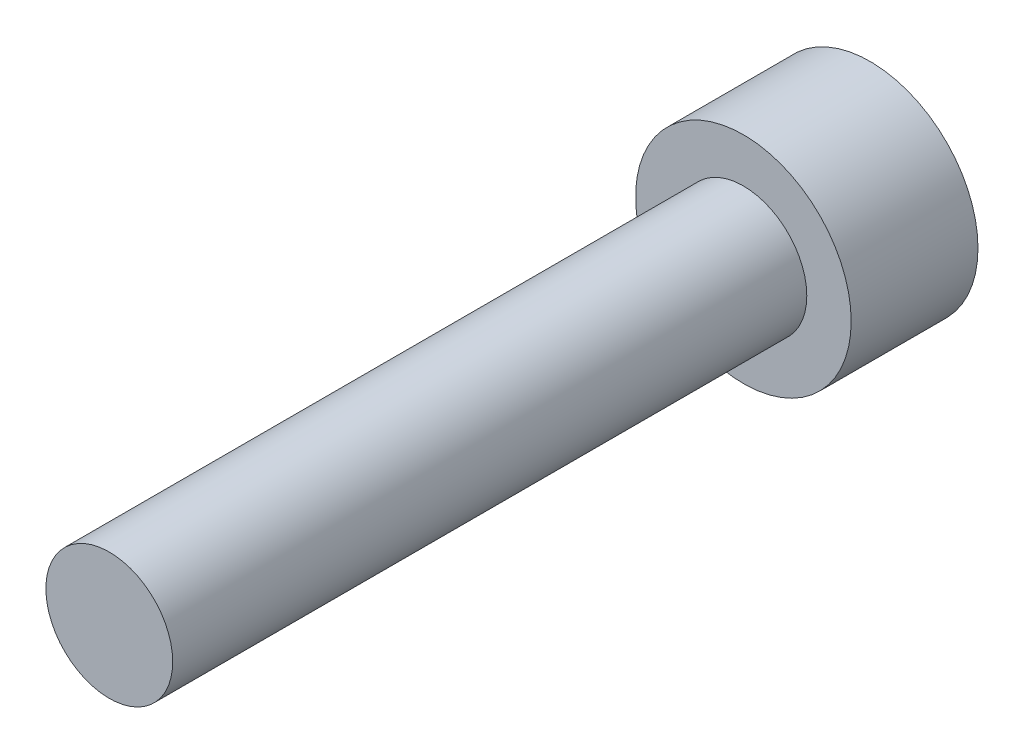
ISO-10303-21;
HEADER;
FILE_DESCRIPTION(('STEP AP214'),'2;1');
FILE_NAME('part.step','',(''),(''),'','','');
FILE_SCHEMA(('AUTOMOTIVE_DESIGN { 1 0 10303 214 1 1 1 1 }'));
ENDSEC;
DATA;
#1=APPLICATION_CONTEXT('core data for automotive mechanical design processes');
#2=APPLICATION_PROTOCOL_DEFINITION('international standard','automotive_design',2000,#1);
#3=PRODUCT_CONTEXT('',#1,'mechanical');
#4=PRODUCT('Part','Part','',(#3));
#5=PRODUCT_RELATED_PRODUCT_CATEGORY('part','',(#4));
#6=PRODUCT_DEFINITION_FORMATION('','',#4);
#7=PRODUCT_DEFINITION_CONTEXT('part definition',#1,'design');
#8=PRODUCT_DEFINITION('design','',#6,#7);
#9=PRODUCT_DEFINITION_SHAPE('','',#8);
#10=(LENGTH_UNIT() NAMED_UNIT(*) SI_UNIT(.MILLI.,.METRE.));
#11=(NAMED_UNIT(*) PLANE_ANGLE_UNIT() SI_UNIT($,.RADIAN.));
#12=(NAMED_UNIT(*) SI_UNIT($,.STERADIAN.) SOLID_ANGLE_UNIT());
#13=UNCERTAINTY_MEASURE_WITH_UNIT(LENGTH_MEASURE(1.E-05),#10,'distance_accuracy_value','');
#14=(GEOMETRIC_REPRESENTATION_CONTEXT(3) GLOBAL_UNCERTAINTY_ASSIGNED_CONTEXT((#13)) GLOBAL_UNIT_ASSIGNED_CONTEXT((#10,
#11,#12)) REPRESENTATION_CONTEXT('',''));
#15=CARTESIAN_POINT('',(0.,0.,0.));
#16=DIRECTION('',(0.,0.,1.));
#17=DIRECTION('',(1.,0.,0.));
#18=AXIS2_PLACEMENT_3D('',#15,#16,#17);
#19=CARTESIAN_POINT('',(0.,0.,25.));
#20=DIRECTION('',(0.,0.,1.));
#21=DIRECTION('',(1.,0.,0.));
#22=AXIS2_PLACEMENT_3D('',#19,#20,#21);
#23=PLANE('',#22);
#24=CARTESIAN_POINT('',(0.,0.,25.));
#25=DIRECTION('',(0.,0.,1.));
#26=DIRECTION('',(1.,0.,0.));
#27=AXIS2_PLACEMENT_3D('',#24,#25,#26);
#28=CIRCLE('',#27,2.5);
#29=CARTESIAN_POINT('',(2.5,0.,25.));
#30=VERTEX_POINT('',#29);
#31=EDGE_CURVE('E11',#30,#30,#28,.T.);
#32=ORIENTED_EDGE('',*,*,#31,.T.);
#33=EDGE_LOOP('',(#32));
#34=FACE_BOUND('',#33,.T.);
#35=ADVANCED_FACE('F32',(#34),#23,.T.);
#36=CARTESIAN_POINT('',(0.,0.,25.));
#37=DIRECTION('',(0.,0.,1.));
#38=DIRECTION('',(1.,0.,0.));
#39=AXIS2_PLACEMENT_3D('',#36,#37,#38);
#40=CYLINDRICAL_SURFACE('',#39,2.5);
#41=CARTESIAN_POINT('',(0.,0.,0.));
#42=DIRECTION('',(0.,0.,1.));
#43=DIRECTION('',(1.,0.,0.));
#44=AXIS2_PLACEMENT_3D('',#41,#42,#43);
#45=CIRCLE('',#44,2.5);
#46=CARTESIAN_POINT('',(2.5,0.,0.));
#47=VERTEX_POINT('',#46);
#48=EDGE_CURVE('E39',#47,#47,#45,.T.);
#49=ORIENTED_EDGE('',*,*,#48,.T.);
#50=EDGE_LOOP('',(#49));
#51=FACE_BOUND('',#50,.T.);
#52=ORIENTED_EDGE('',*,*,#31,.F.);
#53=EDGE_LOOP('',(#52));
#54=FACE_BOUND('',#53,.T.);
#55=ADVANCED_FACE('F146',(#51,#54),#40,.T.);
#56=CARTESIAN_POINT('',(0.,-2.5,0.));
#57=DIRECTION('',(0.,0.,1.));
#58=DIRECTION('',(1.,0.,0.));
#59=AXIS2_PLACEMENT_3D('',#56,#57,#58);
#60=PLANE('',#59);
#61=CARTESIAN_POINT('',(0.,0.,0.));
#62=DIRECTION('',(0.,0.,1.));
#63=DIRECTION('',(1.,0.,0.));
#64=AXIS2_PLACEMENT_3D('',#61,#62,#63);
#65=CIRCLE('',#64,4.25);
#66=CARTESIAN_POINT('',(4.25,0.,0.));
#67=VERTEX_POINT('',#66);
#68=EDGE_CURVE('E141',#67,#67,#65,.T.);
#69=ORIENTED_EDGE('',*,*,#68,.T.);
#70=EDGE_LOOP('',(#69));
#71=FACE_BOUND('',#70,.T.);
#72=ORIENTED_EDGE('',*,*,#48,.F.);
#73=EDGE_LOOP('',(#72));
#74=FACE_BOUND('',#73,.T.);
#75=ADVANCED_FACE('F149',(#71,#74),#60,.T.);
#76=CARTESIAN_POINT('',(0.,0.,25.));
#77=DIRECTION('',(0.,0.,1.));
#78=DIRECTION('',(1.,0.,0.));
#79=AXIS2_PLACEMENT_3D('',#76,#77,#78);
#80=CYLINDRICAL_SURFACE('',#79,4.25);
#81=CARTESIAN_POINT('',(0.,0.,-5.));
#82=DIRECTION('',(0.,0.,1.));
#83=DIRECTION('',(1.,0.,0.));
#84=AXIS2_PLACEMENT_3D('',#81,#82,#83);
#85=CIRCLE('',#84,4.25);
#86=CARTESIAN_POINT('',(4.25,0.,-5.));
#87=VERTEX_POINT('',#86);
#88=EDGE_CURVE('E133',#87,#87,#85,.T.);
#89=ORIENTED_EDGE('',*,*,#88,.T.);
#90=EDGE_LOOP('',(#89));
#91=FACE_BOUND('',#90,.T.);
#92=ORIENTED_EDGE('',*,*,#68,.F.);
#93=EDGE_LOOP('',(#92));
#94=FACE_BOUND('',#93,.T.);
#95=ADVANCED_FACE('F151',(#91,#94),#80,.T.);
#96=CARTESIAN_POINT('',(0.,-4.25,-5.));
#97=DIRECTION('',(0.,0.,-1.));
#98=DIRECTION('',(-1.,0.,0.));
#99=AXIS2_PLACEMENT_3D('',#96,#97,#98);
#100=PLANE('',#99);
#101=DIRECTION('',(0.866025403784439,-0.5,0.));
#102=VECTOR('',#101,1.);
#103=CARTESIAN_POINT('',(0.,2.3094010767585,-5.));
#104=LINE('',#103,#102);
#105=CARTESIAN_POINT('',(0.,2.3094010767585,-5.));
#106=VERTEX_POINT('',#105);
#107=CARTESIAN_POINT('',(2.,1.15470053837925,-5.));
#108=VERTEX_POINT('',#107);
#109=EDGE_CURVE('E46',#106,#108,#104,.T.);
#110=ORIENTED_EDGE('',*,*,#109,.F.);
#111=DIRECTION('',(0.866025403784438,0.5,0.));
#112=VECTOR('',#111,1.);
#113=CARTESIAN_POINT('',(-2.,1.15470053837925,-5.));
#114=LINE('',#113,#112);
#115=CARTESIAN_POINT('',(-2.,1.15470053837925,-5.));
#116=VERTEX_POINT('',#115);
#117=EDGE_CURVE('E129',#116,#106,#114,.T.);
#118=ORIENTED_EDGE('',*,*,#117,.F.);
#119=DIRECTION('',(0.,1.,0.));
#120=VECTOR('',#119,1.);
#121=CARTESIAN_POINT('',(-2.,-1.15470053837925,-5.));
#122=LINE('',#121,#120);
#123=CARTESIAN_POINT('',(-2.,-1.15470053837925,-5.));
#124=VERTEX_POINT('',#123);
#125=EDGE_CURVE('E127',#124,#116,#122,.T.);
#126=ORIENTED_EDGE('',*,*,#125,.F.);
#127=DIRECTION('',(-0.866025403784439,0.5,0.));
#128=VECTOR('',#127,1.);
#129=CARTESIAN_POINT('',(0.,-2.3094010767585,-5.));
#130=LINE('',#129,#128);
#131=CARTESIAN_POINT('',(0.,-2.3094010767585,-5.));
#132=VERTEX_POINT('',#131);
#133=EDGE_CURVE('E94',#132,#124,#130,.T.);
#134=ORIENTED_EDGE('',*,*,#133,.F.);
#135=DIRECTION('',(-0.866025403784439,-0.5,0.));
#136=VECTOR('',#135,1.);
#137=CARTESIAN_POINT('',(2.,-1.15470053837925,-5.));
#138=LINE('',#137,#136);
#139=CARTESIAN_POINT('',(2.,-1.15470053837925,-5.));
#140=VERTEX_POINT('',#139);
#141=EDGE_CURVE('E123',#140,#132,#138,.T.);
#142=ORIENTED_EDGE('',*,*,#141,.F.);
#143=DIRECTION('',(0.,-1.,0.));
#144=VECTOR('',#143,1.);
#145=CARTESIAN_POINT('',(2.,1.15470053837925,-5.));
#146=LINE('',#145,#144);
#147=EDGE_CURVE('E120',#108,#140,#146,.T.);
#148=ORIENTED_EDGE('',*,*,#147,.F.);
#149=EDGE_LOOP('',(#110,#118,#126,#134,#142,#148));
#150=FACE_BOUND('',#149,.T.);
#151=ORIENTED_EDGE('',*,*,#88,.F.);
#152=EDGE_LOOP('',(#151));
#153=FACE_BOUND('',#152,.T.);
#154=ADVANCED_FACE('F158',(#150,#153),#100,.T.);
#155=CARTESIAN_POINT('',(0.,2.3094010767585,-0.999999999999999));
#156=DIRECTION('',(0.5,0.866025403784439,0.));
#157=DIRECTION('',(-0.866025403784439,0.5,0.));
#158=AXIS2_PLACEMENT_3D('',#155,#156,#157);
#159=PLANE('',#158);
#160=ORIENTED_EDGE('',*,*,#109,.T.);
#161=DIRECTION('',(0.,0.,-1.));
#162=VECTOR('',#161,1.);
#163=CARTESIAN_POINT('',(2.,1.15470053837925,-0.999999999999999));
#164=LINE('',#163,#162);
#165=CARTESIAN_POINT('',(2.,1.15470053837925,-0.999999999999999));
#166=VERTEX_POINT('',#165);
#167=EDGE_CURVE('E76',#166,#108,#164,.T.);
#168=ORIENTED_EDGE('',*,*,#167,.F.);
#169=DIRECTION('',(0.866025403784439,-0.5,0.));
#170=VECTOR('',#169,1.);
#171=CARTESIAN_POINT('',(0.,2.3094010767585,-0.999999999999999));
#172=LINE('',#171,#170);
#173=CARTESIAN_POINT('',(0.,2.3094010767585,-0.999999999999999));
#174=VERTEX_POINT('',#173);
#175=EDGE_CURVE('E131',#174,#166,#172,.T.);
#176=ORIENTED_EDGE('',*,*,#175,.F.);
#177=DIRECTION('',(0.,0.,-1.));
#178=VECTOR('',#177,1.);
#179=CARTESIAN_POINT('',(0.,2.3094010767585,-0.999999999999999));
#180=LINE('',#179,#178);
#181=EDGE_CURVE('E54',#174,#106,#180,.T.);
#182=ORIENTED_EDGE('',*,*,#181,.T.);
#183=EDGE_LOOP('',(#160,#168,#176,#182));
#184=FACE_BOUND('',#183,.T.);
#185=ADVANCED_FACE('F189',(#184),#159,.F.);
#186=CARTESIAN_POINT('',(-2.,1.15470053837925,-0.999999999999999));
#187=DIRECTION('',(-0.5,0.866025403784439,0.));
#188=DIRECTION('',(-0.866025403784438,-0.5,0.));
#189=AXIS2_PLACEMENT_3D('',#186,#187,#188);
#190=PLANE('',#189);
#191=ORIENTED_EDGE('',*,*,#117,.T.);
#192=ORIENTED_EDGE('',*,*,#181,.F.);
#193=DIRECTION('',(0.866025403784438,0.5,0.));
#194=VECTOR('',#193,1.);
#195=CARTESIAN_POINT('',(-2.,1.15470053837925,-0.999999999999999));
#196=LINE('',#195,#194);
#197=CARTESIAN_POINT('',(-2.,1.15470053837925,-0.999999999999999));
#198=VERTEX_POINT('',#197);
#199=EDGE_CURVE('E106',#198,#174,#196,.T.);
#200=ORIENTED_EDGE('',*,*,#199,.F.);
#201=DIRECTION('',(0.,0.,-1.));
#202=VECTOR('',#201,1.);
#203=CARTESIAN_POINT('',(-2.,1.15470053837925,-0.999999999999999));
#204=LINE('',#203,#202);
#205=EDGE_CURVE('E98',#198,#116,#204,.T.);
#206=ORIENTED_EDGE('',*,*,#205,.T.);
#207=EDGE_LOOP('',(#191,#192,#200,#206));
#208=FACE_BOUND('',#207,.T.);
#209=ADVANCED_FACE('F199',(#208),#190,.F.);
#210=CARTESIAN_POINT('',(-2.,-1.15470053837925,-0.999999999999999));
#211=DIRECTION('',(-1.,0.,0.));
#212=DIRECTION('',(0.,-1.,0.));
#213=AXIS2_PLACEMENT_3D('',#210,#211,#212);
#214=PLANE('',#213);
#215=ORIENTED_EDGE('',*,*,#125,.T.);
#216=ORIENTED_EDGE('',*,*,#205,.F.);
#217=DIRECTION('',(0.,1.,0.));
#218=VECTOR('',#217,1.);
#219=CARTESIAN_POINT('',(-2.,-1.15470053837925,-0.999999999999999));
#220=LINE('',#219,#218);
#221=CARTESIAN_POINT('',(-2.,-1.15470053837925,-0.999999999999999));
#222=VERTEX_POINT('',#221);
#223=EDGE_CURVE('E102',#222,#198,#220,.T.);
#224=ORIENTED_EDGE('',*,*,#223,.F.);
#225=DIRECTION('',(0.,0.,-1.));
#226=VECTOR('',#225,1.);
#227=CARTESIAN_POINT('',(-2.,-1.15470053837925,-0.999999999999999));
#228=LINE('',#227,#226);
#229=EDGE_CURVE('E87',#222,#124,#228,.T.);
#230=ORIENTED_EDGE('',*,*,#229,.T.);
#231=EDGE_LOOP('',(#215,#216,#224,#230));
#232=FACE_BOUND('',#231,.T.);
#233=ADVANCED_FACE('F103',(#232),#214,.F.);
#234=CARTESIAN_POINT('',(0.,-2.3094010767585,-0.999999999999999));
#235=DIRECTION('',(-0.5,-0.866025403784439,0.));
#236=DIRECTION('',(0.866025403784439,-0.5,0.));
#237=AXIS2_PLACEMENT_3D('',#234,#235,#236);
#238=PLANE('',#237);
#239=ORIENTED_EDGE('',*,*,#133,.T.);
#240=ORIENTED_EDGE('',*,*,#229,.F.);
#241=DIRECTION('',(-0.866025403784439,0.5,0.));
#242=VECTOR('',#241,1.);
#243=CARTESIAN_POINT('',(0.,-2.3094010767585,-0.999999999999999));
#244=LINE('',#243,#242);
#245=CARTESIAN_POINT('',(0.,-2.3094010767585,-0.999999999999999));
#246=VERTEX_POINT('',#245);
#247=EDGE_CURVE('E91',#246,#222,#244,.T.);
#248=ORIENTED_EDGE('',*,*,#247,.F.);
#249=DIRECTION('',(0.,0.,-1.));
#250=VECTOR('',#249,1.);
#251=CARTESIAN_POINT('',(0.,-2.3094010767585,-0.999999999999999));
#252=LINE('',#251,#250);
#253=EDGE_CURVE('E99',#246,#132,#252,.T.);
#254=ORIENTED_EDGE('',*,*,#253,.T.);
#255=EDGE_LOOP('',(#239,#240,#248,#254));
#256=FACE_BOUND('',#255,.T.);
#257=ADVANCED_FACE('F89',(#256),#238,.F.);
#258=CARTESIAN_POINT('',(2.,-1.15470053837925,-0.999999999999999));
#259=DIRECTION('',(0.5,-0.866025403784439,0.));
#260=DIRECTION('',(0.866025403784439,0.5,0.));
#261=AXIS2_PLACEMENT_3D('',#258,#259,#260);
#262=PLANE('',#261);
#263=ORIENTED_EDGE('',*,*,#141,.T.);
#264=ORIENTED_EDGE('',*,*,#253,.F.);
#265=DIRECTION('',(-0.866025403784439,-0.5,0.));
#266=VECTOR('',#265,1.);
#267=CARTESIAN_POINT('',(2.,-1.15470053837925,-0.999999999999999));
#268=LINE('',#267,#266);
#269=CARTESIAN_POINT('',(2.,-1.15470053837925,-0.999999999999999));
#270=VERTEX_POINT('',#269);
#271=EDGE_CURVE('E112',#270,#246,#268,.T.);
#272=ORIENTED_EDGE('',*,*,#271,.F.);
#273=DIRECTION('',(0.,0.,-1.));
#274=VECTOR('',#273,1.);
#275=CARTESIAN_POINT('',(2.,-1.15470053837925,-0.999999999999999));
#276=LINE('',#275,#274);
#277=EDGE_CURVE('E136',#270,#140,#276,.T.);
#278=ORIENTED_EDGE('',*,*,#277,.T.);
#279=EDGE_LOOP('',(#263,#264,#272,#278));
#280=FACE_BOUND('',#279,.T.);
#281=ADVANCED_FACE('F224',(#280),#262,.F.);
#282=CARTESIAN_POINT('',(2.,1.15470053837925,-0.999999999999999));
#283=DIRECTION('',(1.,0.,0.));
#284=DIRECTION('',(0.,0.,-1.));
#285=AXIS2_PLACEMENT_3D('',#282,#283,#284);
#286=PLANE('',#285);
#287=ORIENTED_EDGE('',*,*,#147,.T.);
#288=ORIENTED_EDGE('',*,*,#277,.F.);
#289=DIRECTION('',(0.,-1.,0.));
#290=VECTOR('',#289,1.);
#291=CARTESIAN_POINT('',(2.,1.15470053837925,-0.999999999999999));
#292=LINE('',#291,#290);
#293=EDGE_CURVE('E114',#166,#270,#292,.T.);
#294=ORIENTED_EDGE('',*,*,#293,.F.);
#295=ORIENTED_EDGE('',*,*,#167,.T.);
#296=EDGE_LOOP('',(#287,#288,#294,#295));
#297=FACE_BOUND('',#296,.T.);
#298=ADVANCED_FACE('F233',(#297),#286,.F.);
#299=CARTESIAN_POINT('',(0.,2.3094010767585,-0.999999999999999));
#300=DIRECTION('',(0.,0.,1.));
#301=DIRECTION('',(1.,0.,0.));
#302=AXIS2_PLACEMENT_3D('',#299,#300,#301);
#303=PLANE('',#302);
#304=ORIENTED_EDGE('',*,*,#175,.T.);
#305=ORIENTED_EDGE('',*,*,#293,.T.);
#306=ORIENTED_EDGE('',*,*,#271,.T.);
#307=ORIENTED_EDGE('',*,*,#247,.T.);
#308=ORIENTED_EDGE('',*,*,#223,.T.);
#309=ORIENTED_EDGE('',*,*,#199,.T.);
#310=EDGE_LOOP('',(#304,#305,#306,#307,#308,#309));
#311=FACE_BOUND('',#310,.T.);
#312=ADVANCED_FACE('F109',(#311),#303,.F.);
#313=CLOSED_SHELL('',(#35,#55,#75,#95,#154,#185,#209,#233,#257,#281,#298,#312));
#314=MANIFOLD_SOLID_BREP('B2',#313);
#315=ADVANCED_BREP_SHAPE_REPRESENTATION('',(#18,#314),#14);
#316=SHAPE_DEFINITION_REPRESENTATION(#9,#315);
ENDSEC;
END-ISO-10303-21;
